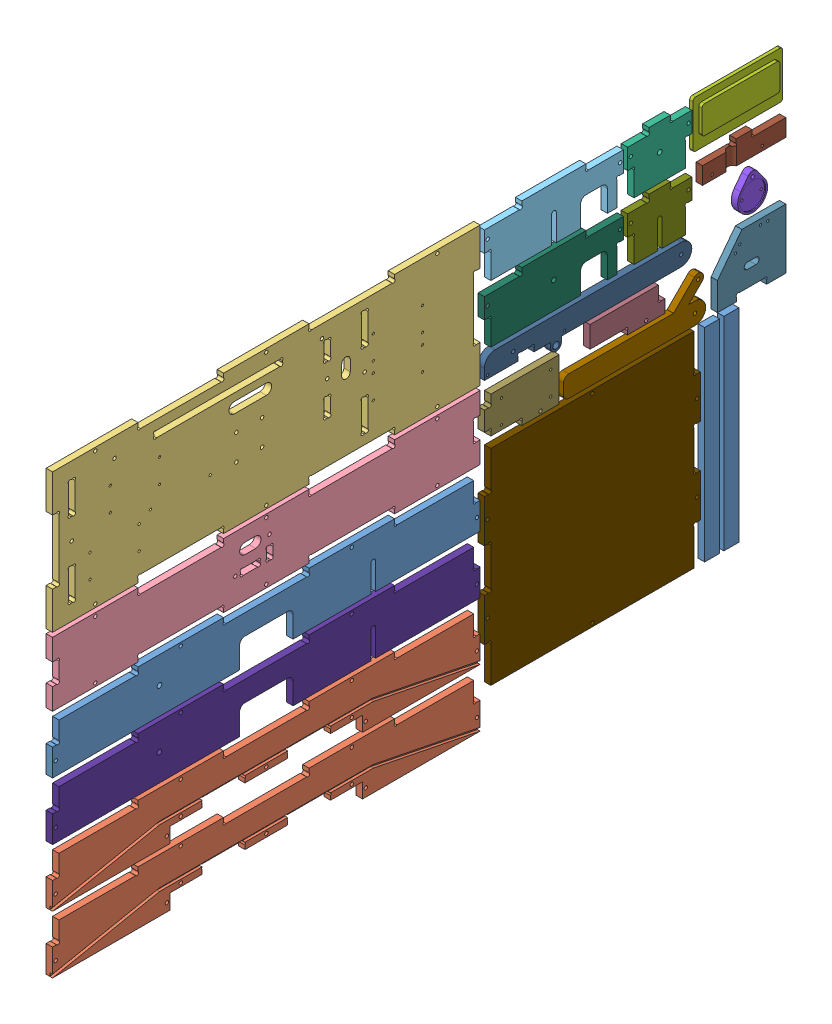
SolidWorks assembly Pièces PVC 6 blanc à plat.SLDASM, configuration Défaut (file format 6000). Lengths in mm.
Overall size (6.19 410 686).
23 component instances, 19 part files, 18 mates.
Components (placement in the parent):
- Côté 400 extérieur gauche-1: Côté 400 extérieur gauche.SLDPRT [Défaut] at (-14.7516 -26.3973 400) size (6 50 400)
- Côté 400 intérieur-1: Côté 400 intérieur.SLDPRT [Défaut] at (-14.7516 -134.3973 400) size (6 50 400)
- Côté 400 intérieur-2: Côté 400 intérieur.SLDPRT [Défaut] at (-14.7516 -188.3973 400) size (6 50 400)
- Dessus trottoir droit-1: Dessus trottoir droit.SLDPRT [Défaut] at (-8.7516 156.6027 400) x (0 0 -1) z (0 1 0) size (400 6 130)
- Dessus trottoir gauche-1: Dessus trottoir gauche.SLDPRT [Défaut] at (-14.7516 57.6027 400) x (0 0 1) z (0 1 0) size (400 6 60)
- Pièces PVC 6 à plat_1-1: Pièces PVC 6 à plat_1.SLDASM [Défaut] at (-141.7516 180.5508 126.2492) x (0 0 -1) z (1 0 0) size (282 182 6.19)
  - Côté 130 arrière-1: Côté 130 arrière.SLDPRT [Défaut] at (-4.7508 -8.948 127) size (130 50 6)
  - Côté 60 arrière-1: Côté 60 arrière.SLDPRT [Défaut] at (94.2492 -8.948 127) size (60 50 6)
  - Cache OLED-1: Cache OLED.SLDPRT [Défaut] at (170.2492 -65.948 130) x (-1 0 0) z (0 0 -1) size (84 44 6)
  - Came de moteur-1: Came de moteur.SLDPRT [Défaut] at (181.1775 -62.4072 127) size (28 34 6)
  - Lisse 01-1: Lisse 01.SLDPRT [Défaut] at (104.2492 -130.948 127) size (133 41 6)
  - Lisse 02-1: Lisse 02.SLDPRT [Défaut] at (-69.7508 -76.948 127) size (194 30 6)
  - Support réglage Fin de course-1: Support réglage Fin de course.SLDPRT [Défaut] at (134.2492 -30.9127 127) x (1 0 0) z (0 -1 0) size (78 6.19 22)
  - Support emetteur IR_A-1: Support emetteur IR_A.SLDPRT [Défaut] at (-69.7508 -119.948 133) x (0 0 -1) z (0 -1 0) size (6 70 40)
  - Support emetteur IR_B-1: Support emetteur IR_B.SLDPRT [Défaut] at (98.9991 -116.948 127) x (0 1 0) z (0 0 1) size (26 70 6)
  - Support Fin de course-1: Support Fin de course.SLDPRT [Défaut] at (212.2492 -140.948 127) size (64 56 6)
  - Côté 130 avant-1: Côté 130 avant.SLDPRT [Défaut] at (-4.7508 -62.948 127) size (130 50 6)
  - Côté 60 avant-1: Côté 60 avant.SLDPRT [Défaut] at (94.2492 -62.948 127) size (60 50 6)
- Côté 400 extérieur droit-1: Côté 400 extérieur droit.SLDPRT [Défaut] at (-14.7516 -80.3973 400) size (6 50 400)
- Pièces PVC 6 à plat_3-1: Pièces PVC 6 à plat_3.SLDASM [Défaut] at (-1.3864 141.6027 88.6954) x (0 0 -1) z (0 -1 0) size (238 6 192)
  - Renfort chaussée-1: Renfort chaussée.SLDPRT [Défaut] at (-6.3046 -13.3652 202) size (202 6 192)
  - Lambourde de renfort chaussée-1: Lambourde de renfort chaussée.SLDPRT [Défaut] at (98.6954 -7.3652 298) x (0 0 -1) z (0 -1 0) size (190 14 6)
  - Lambourde de renfort chaussée-2: Lambourde de renfort chaussée.SLDPRT [Défaut] at (116.6954 -7.3652 298) x (0 0 -1) z (0 -1 0) size (190 14 6)
Mates (geometry in assembly coordinates):
- Coïncidente2: coincident aligned: plane of Côté 400 extérieur gauche-1 through (-8.7516 18.7341 361.1314) normal (1 0 0); plane of Côté 400 intérieur-1 through (-8.7516 -89.2659 361.1314) normal (1 0 0)
- Coïncidente3: coincident aligned: plane of Côté 400 extérieur gauche-1 through (-8.7516 18.7341 361.1314) normal (1 0 0); plane of Côté 400 intérieur-2 through (-8.7516 -143.2659 361.1314) normal (1 0 0)
- Coïncidente5: coincident aligned: plane of Côté 400 extérieur gauche-1 through (-8.7516 -1.3973 600) normal (0 0 1); plane of Côté 400 intérieur-1 through (-8.7516 -109.3973 600) normal (0 0 1)
- Coïncidente6: coincident aligned: plane of Côté 400 extérieur gauche-1 through (-8.7516 -1.3973 600) normal (0 0 1); plane of Côté 400 intérieur-2 through (-8.7516 -163.3973 600) normal (0 0 1)
- Coïncidente7: coincident aligned: plane of Côté 400 extérieur gauche-1 through (-8.7516 18.7341 361.1314) normal (1 0 0); plane of Dessus trottoir gauche-1 through (-8.7516 66.4713 595.1314) normal (1 0 0)
- Coïncidente8: coincident aligned: plane of Côté 400 extérieur gauche-1 through (-8.7516 -1.3973 600) normal (0 0 1); plane of Dessus trottoir gauche-1 through (-8.7516 67.6027 600) normal (0 0 1)
- Distance2: distance = 4 mm anti-aligned: plane of Dessus trottoir gauche-1 through (-8.7516 27.6027 520) normal (0 -1 0); plane of Côté 400 extérieur gauche-1 through (-8.7516 23.6027 440) normal (0 1 0)
- Distance5: distance = 4 mm anti-aligned: plane of Côté 400 intérieur-2 through (-8.7516 -138.3973 440) normal (0 1 0); plane of Côté 400 intérieur-1 through (-8.7516 -134.3973 600) normal (0 -1 0)
- Coïncidente12: coincident aligned: plane of Côté 400 extérieur gauche-1 through (-8.7516 -1.3973 600) normal (0 0 1); plane of Côté 400 extérieur droit-1 through (-8.7516 -55.3973 600) normal (0 0 1)
- Distance6: distance = 4 mm anti-aligned: plane of Côté 400 intérieur-1 through (-8.7516 -84.3973 440) normal (0 1 0); plane of Côté 400 extérieur droit-1 through (-8.7516 -80.3973 600) normal (0 -1 0)
- Coïncidente14: coincident aligned: plane of Côté 400 extérieur gauche-1 through (-14.7516 18.7341 361.1314) normal (-1 0 0); plane of Côté 400 extérieur droit-1 through (-14.7516 -35.2659 361.1314) normal (-1 0 0)
- Coïncidente19: coincident aligned: plane of Dessus trottoir droit-1 through (-14.7516 185.4713 204.8686) normal (-1 0 0); plane of Dessus trottoir gauche-1 through (-14.7516 66.4713 595.1314) normal (-1 0 0)
- Distance8: distance = 4 mm anti-aligned: plane of Dessus trottoir gauche-1 through (-8.7516 87.6027 520) normal (0 1 0); plane of Dessus trottoir droit-1 through (-14.7516 91.6027 280) normal (0 -1 0)
- Coïncidente21: coincident aligned: plane of Dessus trottoir droit-1 through (-14.7516 91.6027 600) normal (0 0 1); plane of Dessus trottoir gauche-1 through (-8.7516 67.6027 600) normal (0 0 1)
- Coïncidente22: coincident aligned: plane of Dessus trottoir gauche-1 through (-14.7516 66.4713 595.1314) normal (-1 0 0); plane of Pièces PVC 6 à plat_3-1/Renfort chaussée-1 through (-14.7516 -41.5643 -1.167) normal (-1 0 0)
- Distance9: distance = 4 mm anti-aligned: plane of Pièces PVC 6 à plat_3-1/Renfort chaussée-1 through (-8.7516 -120.3973 196) normal (0 0 1); plane of Côté 400 extérieur droit-1 through (-8.7516 -55.3973 200) normal (0 0 -1)
- Coïncidente25: coincident aligned: plane of Dessus trottoir droit-1 through (-14.7516 221.6027 280) normal (0 1 0); plane of Pièces PVC 6 à plat_1-1/Côté 130 arrière-1 through (-8.7516 221.6027 161) normal (0 1 0)
- Distance10: distance = 4 mm anti-aligned: plane of Pièces PVC 6 à plat_3-1/Renfort chaussée-1 through (-8.7516 35.6027 190) normal (0 1 0); plane of Pièces PVC 6 à plat_1-1/Lisse 01-1 through (-8.7516 39.6027 117) normal (0 -1 0)
